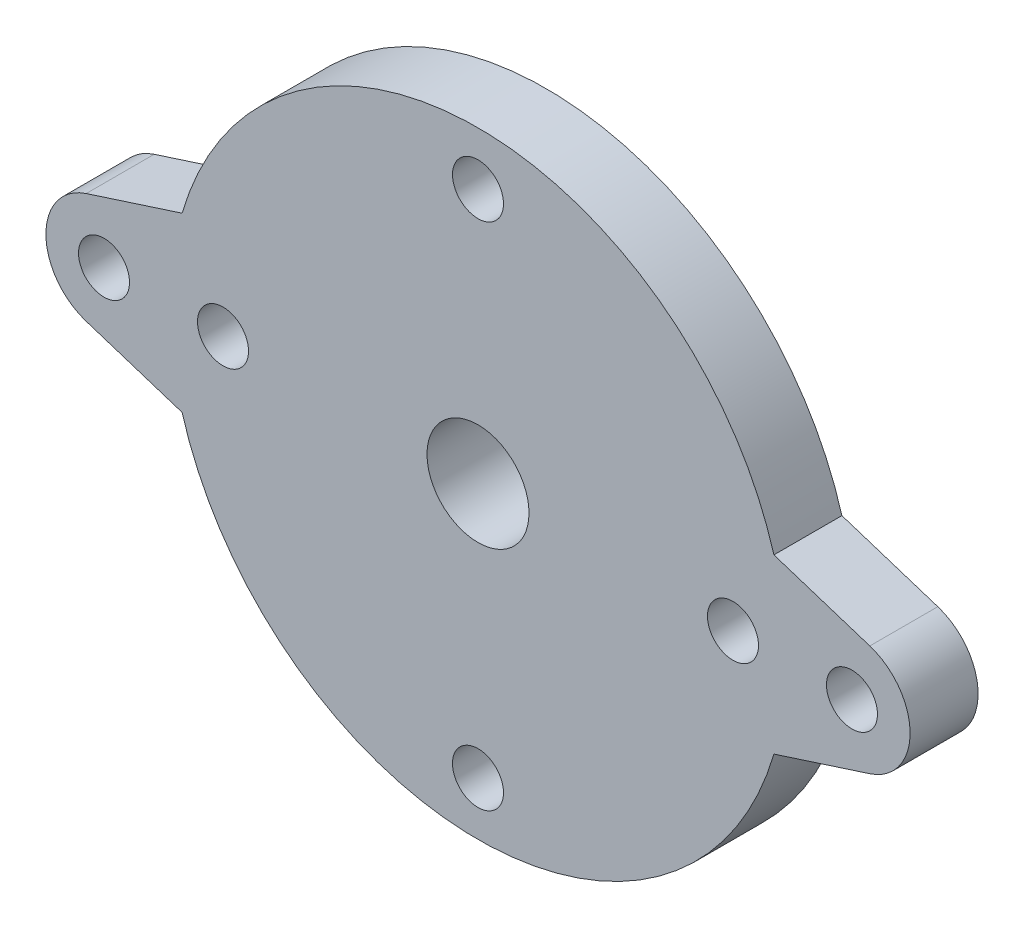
ISO-10303-21;
HEADER;
FILE_DESCRIPTION(('STEP AP214'),'2;1');
FILE_NAME('part.step','',(''),(''),'','','');
FILE_SCHEMA(('AUTOMOTIVE_DESIGN { 1 0 10303 214 1 1 1 1 }'));
ENDSEC;
DATA;
#1=APPLICATION_CONTEXT('core data for automotive mechanical design processes');
#2=APPLICATION_PROTOCOL_DEFINITION('international standard','automotive_design',2000,#1);
#3=PRODUCT_CONTEXT('',#1,'mechanical');
#4=PRODUCT('Part','Part','',(#3));
#5=PRODUCT_RELATED_PRODUCT_CATEGORY('part','',(#4));
#6=PRODUCT_DEFINITION_FORMATION('','',#4);
#7=PRODUCT_DEFINITION_CONTEXT('part definition',#1,'design');
#8=PRODUCT_DEFINITION('design','',#6,#7);
#9=PRODUCT_DEFINITION_SHAPE('','',#8);
#10=(LENGTH_UNIT() NAMED_UNIT(*) SI_UNIT(.MILLI.,.METRE.));
#11=(NAMED_UNIT(*) PLANE_ANGLE_UNIT() SI_UNIT($,.RADIAN.));
#12=(NAMED_UNIT(*) SI_UNIT($,.STERADIAN.) SOLID_ANGLE_UNIT());
#13=UNCERTAINTY_MEASURE_WITH_UNIT(LENGTH_MEASURE(1.E-05),#10,'distance_accuracy_value','');
#14=(GEOMETRIC_REPRESENTATION_CONTEXT(3) GLOBAL_UNCERTAINTY_ASSIGNED_CONTEXT((#13)) GLOBAL_UNIT_ASSIGNED_CONTEXT((#10,
#11,#12)) REPRESENTATION_CONTEXT('',''));
#15=CARTESIAN_POINT('',(0.,0.,0.));
#16=DIRECTION('',(0.,0.,1.));
#17=DIRECTION('',(1.,0.,0.));
#18=AXIS2_PLACEMENT_3D('',#15,#16,#17);
#19=CARTESIAN_POINT('',(-22.,0.,4.));
#20=DIRECTION('',(0.,0.,-1.));
#21=DIRECTION('',(-1.,0.,0.));
#22=AXIS2_PLACEMENT_3D('',#19,#20,#21);
#23=CYLINDRICAL_SURFACE('',#22,1.5);
#24=CARTESIAN_POINT('',(-22.,0.,4.));
#25=DIRECTION('',(0.,0.,-1.));
#26=DIRECTION('',(-1.,0.,0.));
#27=AXIS2_PLACEMENT_3D('',#24,#25,#26);
#28=CIRCLE('',#27,1.5);
#29=CARTESIAN_POINT('',(-23.5,0.,4.));
#30=VERTEX_POINT('',#29);
#31=EDGE_CURVE('E197',#30,#30,#28,.T.);
#32=ORIENTED_EDGE('',*,*,#31,.F.);
#33=EDGE_LOOP('',(#32));
#34=FACE_BOUND('',#33,.T.);
#35=CARTESIAN_POINT('',(-22.,0.,0.2));
#36=DIRECTION('',(0.,0.,-1.));
#37=DIRECTION('',(-1.,0.,0.));
#38=AXIS2_PLACEMENT_3D('',#35,#36,#37);
#39=CIRCLE('',#38,1.5);
#40=CARTESIAN_POINT('',(-23.5,0.,0.2));
#41=VERTEX_POINT('',#40);
#42=EDGE_CURVE('E41',#41,#41,#39,.F.);
#43=ORIENTED_EDGE('',*,*,#42,.F.);
#44=EDGE_LOOP('',(#43));
#45=FACE_BOUND('',#44,.T.);
#46=ADVANCED_FACE('F37',(#34,#45),#23,.F.);
#47=CARTESIAN_POINT('',(22.,0.,4.));
#48=DIRECTION('',(0.,0.,-1.));
#49=DIRECTION('',(-1.,0.,0.));
#50=AXIS2_PLACEMENT_3D('',#47,#48,#49);
#51=CYLINDRICAL_SURFACE('',#50,1.5);
#52=CARTESIAN_POINT('',(22.,0.,4.));
#53=DIRECTION('',(0.,0.,-1.));
#54=DIRECTION('',(-1.,0.,0.));
#55=AXIS2_PLACEMENT_3D('',#52,#53,#54);
#56=CIRCLE('',#55,1.5);
#57=CARTESIAN_POINT('',(20.5,0.,4.));
#58=VERTEX_POINT('',#57);
#59=EDGE_CURVE('E141',#58,#58,#56,.T.);
#60=ORIENTED_EDGE('',*,*,#59,.F.);
#61=EDGE_LOOP('',(#60));
#62=FACE_BOUND('',#61,.T.);
#63=CARTESIAN_POINT('',(22.,0.,0.2));
#64=DIRECTION('',(0.,0.,-1.));
#65=DIRECTION('',(-1.,0.,0.));
#66=AXIS2_PLACEMENT_3D('',#63,#64,#65);
#67=CIRCLE('',#66,1.5);
#68=CARTESIAN_POINT('',(20.5,0.,0.2));
#69=VERTEX_POINT('',#68);
#70=EDGE_CURVE('E165',#69,#69,#67,.F.);
#71=ORIENTED_EDGE('',*,*,#70,.F.);
#72=EDGE_LOOP('',(#71));
#73=FACE_BOUND('',#72,.T.);
#74=ADVANCED_FACE('F231',(#62,#73),#51,.F.);
#75=CARTESIAN_POINT('',(3.12028176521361,9.67942031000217,4.));
#76=DIRECTION('',(-0.306814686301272,-0.951769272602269,0.));
#77=DIRECTION('',(0.951769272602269,-0.306814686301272,0.));
#78=AXIS2_PLACEMENT_3D('',#75,#76,#77);
#79=PLANE('',#78);
#80=DIRECTION('',(-0.951769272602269,0.306814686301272,0.));
#81=VECTOR('',#80,1.);
#82=CARTESIAN_POINT('',(3.12028176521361,9.67942031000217,0.));
#83=LINE('',#82,#81);
#84=CARTESIAN_POINT('',(23.0493062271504,3.25505091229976,0.));
#85=VERTEX_POINT('',#84);
#86=CARTESIAN_POINT('',(17.4077918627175,5.07366337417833,0.));
#87=VERTEX_POINT('',#86);
#88=EDGE_CURVE('E138',#85,#87,#83,.T.);
#89=ORIENTED_EDGE('',*,*,#88,.T.);
#90=DIRECTION('',(0.,0.,-1.));
#91=VECTOR('',#90,1.);
#92=CARTESIAN_POINT('',(17.4077918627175,5.07366337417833,4.));
#93=LINE('',#92,#91);
#94=CARTESIAN_POINT('',(17.4077918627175,5.07366337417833,4.));
#95=VERTEX_POINT('',#94);
#96=EDGE_CURVE('E11',#95,#87,#93,.T.);
#97=ORIENTED_EDGE('',*,*,#96,.F.);
#98=DIRECTION('',(-0.951769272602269,0.306814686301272,0.));
#99=VECTOR('',#98,1.);
#100=CARTESIAN_POINT('',(3.12028176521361,9.67942031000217,4.));
#101=LINE('',#100,#99);
#102=CARTESIAN_POINT('',(23.0493062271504,3.25505091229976,4.));
#103=VERTEX_POINT('',#102);
#104=EDGE_CURVE('E156',#103,#95,#101,.T.);
#105=ORIENTED_EDGE('',*,*,#104,.F.);
#106=DIRECTION('',(0.,0.,-1.));
#107=VECTOR('',#106,1.);
#108=CARTESIAN_POINT('',(23.0493062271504,3.25505091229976,4.));
#109=LINE('',#108,#107);
#110=EDGE_CURVE('E56',#103,#85,#109,.T.);
#111=ORIENTED_EDGE('',*,*,#110,.T.);
#112=EDGE_LOOP('',(#89,#97,#105,#111));
#113=FACE_BOUND('',#112,.T.);
#114=ADVANCED_FACE('F39',(#113),#79,.F.);
#115=CARTESIAN_POINT('',(0.,0.,4.));
#116=DIRECTION('',(0.,0.,-1.));
#117=DIRECTION('',(-1.,0.,0.));
#118=AXIS2_PLACEMENT_3D('',#115,#116,#117);
#119=CYLINDRICAL_SURFACE('',#118,18.1321062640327);
#120=CARTESIAN_POINT('',(0.,0.,0.));
#121=DIRECTION('',(0.,0.,1.));
#122=DIRECTION('',(1.,0.,0.));
#123=AXIS2_PLACEMENT_3D('',#120,#121,#122);
#124=CIRCLE('',#123,18.1321062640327);
#125=CARTESIAN_POINT('',(-17.4077918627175,5.07366337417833,0.));
#126=VERTEX_POINT('',#125);
#127=EDGE_CURVE('E140',#87,#126,#124,.T.);
#128=ORIENTED_EDGE('',*,*,#127,.T.);
#129=DIRECTION('',(0.,0.,-1.));
#130=VECTOR('',#129,1.);
#131=CARTESIAN_POINT('',(-17.4077918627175,5.07366337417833,4.));
#132=LINE('',#131,#130);
#133=CARTESIAN_POINT('',(-17.4077918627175,5.07366337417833,4.));
#134=VERTEX_POINT('',#133);
#135=EDGE_CURVE('E47',#134,#126,#132,.T.);
#136=ORIENTED_EDGE('',*,*,#135,.F.);
#137=CARTESIAN_POINT('',(0.,0.,4.));
#138=DIRECTION('',(0.,0.,1.));
#139=DIRECTION('',(1.,0.,0.));
#140=AXIS2_PLACEMENT_3D('',#137,#138,#139);
#141=CIRCLE('',#140,18.1321062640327);
#142=EDGE_CURVE('E94',#95,#134,#141,.T.);
#143=ORIENTED_EDGE('',*,*,#142,.F.);
#144=ORIENTED_EDGE('',*,*,#96,.T.);
#145=EDGE_LOOP('',(#128,#136,#143,#144));
#146=FACE_BOUND('',#145,.T.);
#147=ADVANCED_FACE('F628',(#146),#119,.T.);
#148=CARTESIAN_POINT('',(-3.12028176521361,9.67942031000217,4.));
#149=DIRECTION('',(-0.306814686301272,0.951769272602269,0.));
#150=DIRECTION('',(-0.951769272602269,-0.306814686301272,0.));
#151=AXIS2_PLACEMENT_3D('',#148,#149,#150);
#152=PLANE('',#151);
#153=DIRECTION('',(0.951769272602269,0.306814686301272,0.));
#154=VECTOR('',#153,1.);
#155=CARTESIAN_POINT('',(-3.12028176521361,9.67942031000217,0.));
#156=LINE('',#155,#154);
#157=CARTESIAN_POINT('',(-23.0493062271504,3.25505091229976,0.));
#158=VERTEX_POINT('',#157);
#159=EDGE_CURVE('E144',#158,#126,#156,.T.);
#160=ORIENTED_EDGE('',*,*,#159,.F.);
#161=DIRECTION('',(0.,0.,-1.));
#162=VECTOR('',#161,1.);
#163=CARTESIAN_POINT('',(-23.0493062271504,3.25505091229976,4.));
#164=LINE('',#163,#162);
#165=CARTESIAN_POINT('',(-23.0493062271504,3.25505091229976,4.));
#166=VERTEX_POINT('',#165);
#167=EDGE_CURVE('E163',#166,#158,#164,.T.);
#168=ORIENTED_EDGE('',*,*,#167,.F.);
#169=DIRECTION('',(0.951769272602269,0.306814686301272,0.));
#170=VECTOR('',#169,1.);
#171=CARTESIAN_POINT('',(-3.12028176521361,9.67942031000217,4.));
#172=LINE('',#171,#170);
#173=EDGE_CURVE('E205',#166,#134,#172,.T.);
#174=ORIENTED_EDGE('',*,*,#173,.T.);
#175=ORIENTED_EDGE('',*,*,#135,.T.);
#176=EDGE_LOOP('',(#160,#168,#174,#175));
#177=FACE_BOUND('',#176,.T.);
#178=ADVANCED_FACE('F337',(#177),#152,.T.);
#179=CARTESIAN_POINT('',(-22.,0.,4.));
#180=DIRECTION('',(0.,0.,-1.));
#181=DIRECTION('',(-1.,0.,0.));
#182=AXIS2_PLACEMENT_3D('',#179,#180,#181);
#183=CYLINDRICAL_SURFACE('',#182,3.42);
#184=CARTESIAN_POINT('',(-22.,0.,0.));
#185=DIRECTION('',(0.,0.,1.));
#186=DIRECTION('',(1.,0.,0.));
#187=AXIS2_PLACEMENT_3D('',#184,#185,#186);
#188=CIRCLE('',#187,3.42);
#189=CARTESIAN_POINT('',(-23.0493062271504,-3.25505091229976,0.));
#190=VERTEX_POINT('',#189);
#191=EDGE_CURVE('E147',#158,#190,#188,.T.);
#192=ORIENTED_EDGE('',*,*,#191,.T.);
#193=DIRECTION('',(0.,0.,-1.));
#194=VECTOR('',#193,1.);
#195=CARTESIAN_POINT('',(-23.0493062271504,-3.25505091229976,4.));
#196=LINE('',#195,#194);
#197=CARTESIAN_POINT('',(-23.0493062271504,-3.25505091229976,4.));
#198=VERTEX_POINT('',#197);
#199=EDGE_CURVE('E160',#198,#190,#196,.T.);
#200=ORIENTED_EDGE('',*,*,#199,.F.);
#201=CARTESIAN_POINT('',(-22.,0.,4.));
#202=DIRECTION('',(0.,0.,1.));
#203=DIRECTION('',(1.,0.,0.));
#204=AXIS2_PLACEMENT_3D('',#201,#202,#203);
#205=CIRCLE('',#204,3.42);
#206=EDGE_CURVE('E207',#166,#198,#205,.T.);
#207=ORIENTED_EDGE('',*,*,#206,.F.);
#208=ORIENTED_EDGE('',*,*,#167,.T.);
#209=EDGE_LOOP('',(#192,#200,#207,#208));
#210=FACE_BOUND('',#209,.T.);
#211=ADVANCED_FACE('F212',(#210),#183,.T.);
#212=CARTESIAN_POINT('',(-3.12028176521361,-9.67942031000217,4.));
#213=DIRECTION('',(0.306814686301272,0.951769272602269,0.));
#214=DIRECTION('',(-0.951769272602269,0.306814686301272,0.));
#215=AXIS2_PLACEMENT_3D('',#212,#213,#214);
#216=PLANE('',#215);
#217=DIRECTION('',(0.951769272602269,-0.306814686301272,0.));
#218=VECTOR('',#217,1.);
#219=CARTESIAN_POINT('',(-3.12028176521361,-9.67942031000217,0.));
#220=LINE('',#219,#218);
#221=CARTESIAN_POINT('',(-17.4077918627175,-5.07366337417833,0.));
#222=VERTEX_POINT('',#221);
#223=EDGE_CURVE('E149',#190,#222,#220,.T.);
#224=ORIENTED_EDGE('',*,*,#223,.T.);
#225=DIRECTION('',(0.,0.,-1.));
#226=VECTOR('',#225,1.);
#227=CARTESIAN_POINT('',(-17.4077918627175,-5.07366337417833,4.));
#228=LINE('',#227,#226);
#229=CARTESIAN_POINT('',(-17.4077918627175,-5.07366337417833,4.));
#230=VERTEX_POINT('',#229);
#231=EDGE_CURVE('E129',#230,#222,#228,.T.);
#232=ORIENTED_EDGE('',*,*,#231,.F.);
#233=DIRECTION('',(0.951769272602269,-0.306814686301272,0.));
#234=VECTOR('',#233,1.);
#235=CARTESIAN_POINT('',(-3.12028176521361,-9.67942031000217,4.));
#236=LINE('',#235,#234);
#237=EDGE_CURVE('E117',#198,#230,#236,.T.);
#238=ORIENTED_EDGE('',*,*,#237,.F.);
#239=ORIENTED_EDGE('',*,*,#199,.T.);
#240=EDGE_LOOP('',(#224,#232,#238,#239));
#241=FACE_BOUND('',#240,.T.);
#242=ADVANCED_FACE('F216',(#241),#216,.F.);
#243=CARTESIAN_POINT('',(17.4077918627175,-5.07366337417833,0.));
#244=VERTEX_POINT('',#243);
#245=EDGE_CURVE('E126',#222,#244,#124,.T.);
#246=ORIENTED_EDGE('',*,*,#245,.T.);
#247=DIRECTION('',(0.,0.,-1.));
#248=VECTOR('',#247,1.);
#249=CARTESIAN_POINT('',(17.4077918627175,-5.07366337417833,4.));
#250=LINE('',#249,#248);
#251=CARTESIAN_POINT('',(17.4077918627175,-5.07366337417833,4.));
#252=VERTEX_POINT('',#251);
#253=EDGE_CURVE('E123',#252,#244,#250,.T.);
#254=ORIENTED_EDGE('',*,*,#253,.F.);
#255=EDGE_CURVE('E110',#230,#252,#141,.T.);
#256=ORIENTED_EDGE('',*,*,#255,.F.);
#257=ORIENTED_EDGE('',*,*,#231,.T.);
#258=EDGE_LOOP('',(#246,#254,#256,#257));
#259=FACE_BOUND('',#258,.T.);
#260=ADVANCED_FACE('F124',(#259),#119,.T.);
#261=CARTESIAN_POINT('',(3.12028176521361,-9.67942031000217,4.));
#262=DIRECTION('',(0.306814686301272,-0.951769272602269,0.));
#263=DIRECTION('',(0.951769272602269,0.306814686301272,0.));
#264=AXIS2_PLACEMENT_3D('',#261,#262,#263);
#265=PLANE('',#264);
#266=DIRECTION('',(-0.951769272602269,-0.306814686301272,0.));
#267=VECTOR('',#266,1.);
#268=CARTESIAN_POINT('',(3.12028176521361,-9.67942031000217,0.));
#269=LINE('',#268,#267);
#270=CARTESIAN_POINT('',(23.0493062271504,-3.25505091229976,0.));
#271=VERTEX_POINT('',#270);
#272=EDGE_CURVE('E151',#271,#244,#269,.T.);
#273=ORIENTED_EDGE('',*,*,#272,.F.);
#274=DIRECTION('',(0.,0.,-1.));
#275=VECTOR('',#274,1.);
#276=CARTESIAN_POINT('',(23.0493062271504,-3.25505091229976,4.));
#277=LINE('',#276,#275);
#278=CARTESIAN_POINT('',(23.0493062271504,-3.25505091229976,4.));
#279=VERTEX_POINT('',#278);
#280=EDGE_CURVE('E82',#279,#271,#277,.T.);
#281=ORIENTED_EDGE('',*,*,#280,.F.);
#282=DIRECTION('',(-0.951769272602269,-0.306814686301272,0.));
#283=VECTOR('',#282,1.);
#284=CARTESIAN_POINT('',(3.12028176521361,-9.67942031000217,4.));
#285=LINE('',#284,#283);
#286=EDGE_CURVE('E115',#279,#252,#285,.T.);
#287=ORIENTED_EDGE('',*,*,#286,.T.);
#288=ORIENTED_EDGE('',*,*,#253,.T.);
#289=EDGE_LOOP('',(#273,#281,#287,#288));
#290=FACE_BOUND('',#289,.T.);
#291=ADVANCED_FACE('F131',(#290),#265,.T.);
#292=CARTESIAN_POINT('',(22.,0.,4.));
#293=DIRECTION('',(0.,0.,-1.));
#294=DIRECTION('',(-1.,0.,0.));
#295=AXIS2_PLACEMENT_3D('',#292,#293,#294);
#296=CYLINDRICAL_SURFACE('',#295,3.42);
#297=CARTESIAN_POINT('',(22.,0.,0.));
#298=DIRECTION('',(0.,0.,1.));
#299=DIRECTION('',(1.,0.,0.));
#300=AXIS2_PLACEMENT_3D('',#297,#298,#299);
#301=CIRCLE('',#300,3.42);
#302=EDGE_CURVE('E153',#85,#271,#301,.F.);
#303=ORIENTED_EDGE('',*,*,#302,.F.);
#304=ORIENTED_EDGE('',*,*,#110,.F.);
#305=CARTESIAN_POINT('',(22.,0.,4.));
#306=DIRECTION('',(0.,0.,1.));
#307=DIRECTION('',(1.,0.,0.));
#308=AXIS2_PLACEMENT_3D('',#305,#306,#307);
#309=CIRCLE('',#308,3.42);
#310=EDGE_CURVE('E132',#103,#279,#309,.F.);
#311=ORIENTED_EDGE('',*,*,#310,.T.);
#312=ORIENTED_EDGE('',*,*,#280,.T.);
#313=EDGE_LOOP('',(#303,#304,#311,#312));
#314=FACE_BOUND('',#313,.T.);
#315=ADVANCED_FACE('F219',(#314),#296,.T.);
#316=CARTESIAN_POINT('',(0.,0.,4.));
#317=DIRECTION('',(0.,0.,1.));
#318=DIRECTION('',(1.,0.,0.));
#319=AXIS2_PLACEMENT_3D('',#316,#317,#318);
#320=PLANE('',#319);
#321=CARTESIAN_POINT('',(0.,-15.,4.));
#322=DIRECTION('',(0.,0.,1.));
#323=DIRECTION('',(1.,0.,0.));
#324=AXIS2_PLACEMENT_3D('',#321,#322,#323);
#325=CIRCLE('',#324,1.5);
#326=CARTESIAN_POINT('',(1.5,-15.,4.));
#327=VERTEX_POINT('',#326);
#328=EDGE_CURVE('E511',#327,#327,#325,.T.);
#329=ORIENTED_EDGE('',*,*,#328,.F.);
#330=EDGE_LOOP('',(#329));
#331=FACE_BOUND('',#330,.T.);
#332=CARTESIAN_POINT('',(-15.,0.,4.));
#333=DIRECTION('',(0.,0.,1.));
#334=DIRECTION('',(1.,0.,0.));
#335=AXIS2_PLACEMENT_3D('',#332,#333,#334);
#336=CIRCLE('',#335,1.5);
#337=CARTESIAN_POINT('',(-13.5,0.,4.));
#338=VERTEX_POINT('',#337);
#339=EDGE_CURVE('E505',#338,#338,#336,.T.);
#340=ORIENTED_EDGE('',*,*,#339,.F.);
#341=EDGE_LOOP('',(#340));
#342=FACE_BOUND('',#341,.T.);
#343=CARTESIAN_POINT('',(0.,15.,4.));
#344=DIRECTION('',(0.,0.,1.));
#345=DIRECTION('',(1.,0.,0.));
#346=AXIS2_PLACEMENT_3D('',#343,#344,#345);
#347=CIRCLE('',#346,1.5);
#348=CARTESIAN_POINT('',(1.5,15.,4.));
#349=VERTEX_POINT('',#348);
#350=EDGE_CURVE('E499',#349,#349,#347,.T.);
#351=ORIENTED_EDGE('',*,*,#350,.F.);
#352=EDGE_LOOP('',(#351));
#353=FACE_BOUND('',#352,.T.);
#354=CARTESIAN_POINT('',(15.,0.,4.));
#355=DIRECTION('',(0.,0.,1.));
#356=DIRECTION('',(1.,0.,0.));
#357=AXIS2_PLACEMENT_3D('',#354,#355,#356);
#358=CIRCLE('',#357,1.5);
#359=CARTESIAN_POINT('',(16.5,0.,4.));
#360=VERTEX_POINT('',#359);
#361=EDGE_CURVE('E491',#360,#360,#358,.T.);
#362=ORIENTED_EDGE('',*,*,#361,.F.);
#363=EDGE_LOOP('',(#362));
#364=FACE_BOUND('',#363,.T.);
#365=CARTESIAN_POINT('',(0.,0.,4.));
#366=DIRECTION('',(0.,0.,1.));
#367=DIRECTION('',(1.,0.,0.));
#368=AXIS2_PLACEMENT_3D('',#365,#366,#367);
#369=CIRCLE('',#368,3.);
#370=CARTESIAN_POINT('',(3.,0.,4.));
#371=VERTEX_POINT('',#370);
#372=EDGE_CURVE('E172',#371,#371,#369,.T.);
#373=ORIENTED_EDGE('',*,*,#372,.F.);
#374=EDGE_LOOP('',(#373));
#375=FACE_BOUND('',#374,.T.);
#376=ORIENTED_EDGE('',*,*,#31,.T.);
#377=EDGE_LOOP('',(#376));
#378=FACE_BOUND('',#377,.T.);
#379=ORIENTED_EDGE('',*,*,#59,.T.);
#380=EDGE_LOOP('',(#379));
#381=FACE_BOUND('',#380,.T.);
#382=ORIENTED_EDGE('',*,*,#104,.T.);
#383=ORIENTED_EDGE('',*,*,#142,.T.);
#384=ORIENTED_EDGE('',*,*,#173,.F.);
#385=ORIENTED_EDGE('',*,*,#206,.T.);
#386=ORIENTED_EDGE('',*,*,#237,.T.);
#387=ORIENTED_EDGE('',*,*,#255,.T.);
#388=ORIENTED_EDGE('',*,*,#286,.F.);
#389=ORIENTED_EDGE('',*,*,#310,.F.);
#390=EDGE_LOOP('',(#382,#383,#384,#385,#386,#387,#388,#389));
#391=FACE_BOUND('',#390,.T.);
#392=ADVANCED_FACE('F112',(#331,#342,#353,#364,#375,#378,#381,#391),#320,.T.);
#393=CARTESIAN_POINT('',(0.,0.,0.));
#394=DIRECTION('',(0.,0.,1.));
#395=DIRECTION('',(1.,0.,0.));
#396=AXIS2_PLACEMENT_3D('',#393,#394,#395);
#397=PLANE('',#396);
#398=CARTESIAN_POINT('',(0.,-15.,0.));
#399=DIRECTION('',(0.,0.,-1.));
#400=DIRECTION('',(-1.,0.,0.));
#401=AXIS2_PLACEMENT_3D('',#398,#399,#400);
#402=CIRCLE('',#401,2.);
#403=CARTESIAN_POINT('',(-2.,-15.,0.));
#404=VERTEX_POINT('',#403);
#405=EDGE_CURVE('E254',#404,#404,#402,.T.);
#406=ORIENTED_EDGE('',*,*,#405,.F.);
#407=EDGE_LOOP('',(#406));
#408=FACE_BOUND('',#407,.T.);
#409=CARTESIAN_POINT('',(-15.,0.,0.));
#410=DIRECTION('',(0.,0.,-1.));
#411=DIRECTION('',(-1.,0.,0.));
#412=AXIS2_PLACEMENT_3D('',#409,#410,#411);
#413=CIRCLE('',#412,2.);
#414=CARTESIAN_POINT('',(-17.,0.,0.));
#415=VERTEX_POINT('',#414);
#416=EDGE_CURVE('E258',#415,#415,#413,.T.);
#417=ORIENTED_EDGE('',*,*,#416,.F.);
#418=EDGE_LOOP('',(#417));
#419=FACE_BOUND('',#418,.T.);
#420=CARTESIAN_POINT('',(0.,15.,0.));
#421=DIRECTION('',(0.,0.,-1.));
#422=DIRECTION('',(-1.,0.,0.));
#423=AXIS2_PLACEMENT_3D('',#420,#421,#422);
#424=CIRCLE('',#423,2.);
#425=CARTESIAN_POINT('',(-2.,15.,0.));
#426=VERTEX_POINT('',#425);
#427=EDGE_CURVE('E262',#426,#426,#424,.T.);
#428=ORIENTED_EDGE('',*,*,#427,.F.);
#429=EDGE_LOOP('',(#428));
#430=FACE_BOUND('',#429,.T.);
#431=CARTESIAN_POINT('',(15.,0.,0.));
#432=DIRECTION('',(0.,0.,-1.));
#433=DIRECTION('',(-1.,0.,0.));
#434=AXIS2_PLACEMENT_3D('',#431,#432,#433);
#435=CIRCLE('',#434,2.);
#436=CARTESIAN_POINT('',(13.,0.,0.));
#437=VERTEX_POINT('',#436);
#438=EDGE_CURVE('E266',#437,#437,#435,.T.);
#439=ORIENTED_EDGE('',*,*,#438,.F.);
#440=EDGE_LOOP('',(#439));
#441=FACE_BOUND('',#440,.T.);
#442=CARTESIAN_POINT('',(-22.,0.,0.));
#443=DIRECTION('',(0.,0.,-1.));
#444=DIRECTION('',(-1.,0.,0.));
#445=AXIS2_PLACEMENT_3D('',#442,#443,#444);
#446=CIRCLE('',#445,2.99999999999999);
#447=CARTESIAN_POINT('',(-25.,0.,0.));
#448=VERTEX_POINT('',#447);
#449=EDGE_CURVE('E182',#448,#448,#446,.T.);
#450=ORIENTED_EDGE('',*,*,#449,.F.);
#451=EDGE_LOOP('',(#450));
#452=FACE_BOUND('',#451,.T.);
#453=CARTESIAN_POINT('',(22.,0.,0.));
#454=DIRECTION('',(0.,0.,-1.));
#455=DIRECTION('',(-1.,0.,0.));
#456=AXIS2_PLACEMENT_3D('',#453,#454,#455);
#457=CIRCLE('',#456,3.);
#458=CARTESIAN_POINT('',(19.,0.,0.));
#459=VERTEX_POINT('',#458);
#460=EDGE_CURVE('E175',#459,#459,#457,.T.);
#461=ORIENTED_EDGE('',*,*,#460,.F.);
#462=EDGE_LOOP('',(#461));
#463=FACE_BOUND('',#462,.T.);
#464=CARTESIAN_POINT('',(0.,0.,0.));
#465=DIRECTION('',(0.,0.,-1.));
#466=DIRECTION('',(-1.,0.,0.));
#467=AXIS2_PLACEMENT_3D('',#464,#465,#466);
#468=CIRCLE('',#467,8.4);
#469=CARTESIAN_POINT('',(-8.4,0.,0.));
#470=VERTEX_POINT('',#469);
#471=EDGE_CURVE('E193',#470,#470,#468,.T.);
#472=ORIENTED_EDGE('',*,*,#471,.F.);
#473=EDGE_LOOP('',(#472));
#474=FACE_BOUND('',#473,.T.);
#475=ORIENTED_EDGE('',*,*,#88,.F.);
#476=ORIENTED_EDGE('',*,*,#302,.T.);
#477=ORIENTED_EDGE('',*,*,#272,.T.);
#478=ORIENTED_EDGE('',*,*,#245,.F.);
#479=ORIENTED_EDGE('',*,*,#223,.F.);
#480=ORIENTED_EDGE('',*,*,#191,.F.);
#481=ORIENTED_EDGE('',*,*,#159,.T.);
#482=ORIENTED_EDGE('',*,*,#127,.F.);
#483=EDGE_LOOP('',(#475,#476,#477,#478,#479,#480,#481,#482));
#484=FACE_BOUND('',#483,.T.);
#485=ADVANCED_FACE('F218',(#408,#419,#430,#441,#452,#463,#474,#484),#397,.F.);
#486=CARTESIAN_POINT('',(0.,0.,0.5));
#487=DIRECTION('',(0.,0.,-1.));
#488=DIRECTION('',(-1.,0.,0.));
#489=AXIS2_PLACEMENT_3D('',#486,#487,#488);
#490=CYLINDRICAL_SURFACE('',#489,8.4);
#491=CARTESIAN_POINT('',(0.,0.,0.5));
#492=DIRECTION('',(0.,0.,-1.));
#493=DIRECTION('',(-1.,0.,0.));
#494=AXIS2_PLACEMENT_3D('',#491,#492,#493);
#495=CIRCLE('',#494,8.4);
#496=CARTESIAN_POINT('',(-8.4,0.,0.5));
#497=VERTEX_POINT('',#496);
#498=EDGE_CURVE('E194',#497,#497,#495,.T.);
#499=ORIENTED_EDGE('',*,*,#498,.F.);
#500=EDGE_LOOP('',(#499));
#501=FACE_BOUND('',#500,.T.);
#502=ORIENTED_EDGE('',*,*,#471,.T.);
#503=EDGE_LOOP('',(#502));
#504=FACE_BOUND('',#503,.T.);
#505=ADVANCED_FACE('F242',(#501,#504),#490,.F.);
#506=CARTESIAN_POINT('',(0.,0.,0.5));
#507=DIRECTION('',(0.,0.,-1.));
#508=DIRECTION('',(-1.,0.,0.));
#509=AXIS2_PLACEMENT_3D('',#506,#507,#508);
#510=PLANE('',#509);
#511=CARTESIAN_POINT('',(0.,0.,0.5));
#512=DIRECTION('',(0.,0.,-1.));
#513=DIRECTION('',(-1.,0.,0.));
#514=AXIS2_PLACEMENT_3D('',#511,#512,#513);
#515=CIRCLE('',#514,8.);
#516=CARTESIAN_POINT('',(-8.,0.,0.5));
#517=VERTEX_POINT('',#516);
#518=EDGE_CURVE('E190',#517,#517,#515,.T.);
#519=ORIENTED_EDGE('',*,*,#518,.F.);
#520=EDGE_LOOP('',(#519));
#521=FACE_BOUND('',#520,.T.);
#522=ORIENTED_EDGE('',*,*,#498,.T.);
#523=EDGE_LOOP('',(#522));
#524=FACE_BOUND('',#523,.T.);
#525=ADVANCED_FACE('F249',(#521,#524),#510,.T.);
#526=CARTESIAN_POINT('',(0.,0.,0.5));
#527=DIRECTION('',(0.,0.,-1.));
#528=DIRECTION('',(-1.,0.,0.));
#529=AXIS2_PLACEMENT_3D('',#526,#527,#528);
#530=CYLINDRICAL_SURFACE('',#529,8.);
#531=ORIENTED_EDGE('',*,*,#518,.T.);
#532=EDGE_LOOP('',(#531));
#533=FACE_BOUND('',#532,.T.);
#534=CARTESIAN_POINT('',(0.,0.,-2.2));
#535=DIRECTION('',(0.,0.,-1.));
#536=DIRECTION('',(-1.,0.,0.));
#537=AXIS2_PLACEMENT_3D('',#534,#535,#536);
#538=CIRCLE('',#537,8.);
#539=CARTESIAN_POINT('',(-8.,0.,-2.2));
#540=VERTEX_POINT('',#539);
#541=EDGE_CURVE('E187',#540,#540,#538,.T.);
#542=ORIENTED_EDGE('',*,*,#541,.F.);
#543=EDGE_LOOP('',(#542));
#544=FACE_BOUND('',#543,.T.);
#545=ADVANCED_FACE('F298',(#533,#544),#530,.T.);
#546=CARTESIAN_POINT('',(0.,0.,-2.2));
#547=DIRECTION('',(0.,0.,-1.));
#548=DIRECTION('',(-1.,0.,0.));
#549=AXIS2_PLACEMENT_3D('',#546,#547,#548);
#550=PLANE('',#549);
#551=CARTESIAN_POINT('',(0.,0.,-2.2));
#552=DIRECTION('',(0.,0.,-1.));
#553=DIRECTION('',(-1.,0.,0.));
#554=AXIS2_PLACEMENT_3D('',#551,#552,#553);
#555=CIRCLE('',#554,3.);
#556=CARTESIAN_POINT('',(-3.,0.,-2.2));
#557=VERTEX_POINT('',#556);
#558=EDGE_CURVE('E167',#557,#557,#555,.T.);
#559=ORIENTED_EDGE('',*,*,#558,.F.);
#560=EDGE_LOOP('',(#559));
#561=FACE_BOUND('',#560,.T.);
#562=ORIENTED_EDGE('',*,*,#541,.T.);
#563=EDGE_LOOP('',(#562));
#564=FACE_BOUND('',#563,.T.);
#565=ADVANCED_FACE('F294',(#561,#564),#550,.T.);
#566=CARTESIAN_POINT('',(0.,0.,17.8));
#567=DIRECTION('',(0.,0.,-1.));
#568=DIRECTION('',(-1.,0.,0.));
#569=AXIS2_PLACEMENT_3D('',#566,#567,#568);
#570=CYLINDRICAL_SURFACE('',#569,3.);
#571=ORIENTED_EDGE('',*,*,#372,.T.);
#572=EDGE_LOOP('',(#571));
#573=FACE_BOUND('',#572,.T.);
#574=ORIENTED_EDGE('',*,*,#558,.T.);
#575=EDGE_LOOP('',(#574));
#576=FACE_BOUND('',#575,.T.);
#577=ADVANCED_FACE('F288',(#573,#576),#570,.F.);
#578=CARTESIAN_POINT('',(22.,0.,0.2));
#579=DIRECTION('',(0.,0.,-1.));
#580=DIRECTION('',(-1.,0.,0.));
#581=AXIS2_PLACEMENT_3D('',#578,#579,#580);
#582=PLANE('',#581);
#583=CARTESIAN_POINT('',(22.,0.,0.2));
#584=DIRECTION('',(0.,0.,-1.));
#585=DIRECTION('',(-1.,0.,0.));
#586=AXIS2_PLACEMENT_3D('',#583,#584,#585);
#587=CIRCLE('',#586,3.);
#588=CARTESIAN_POINT('',(19.,0.,0.2));
#589=VERTEX_POINT('',#588);
#590=EDGE_CURVE('E168',#589,#589,#587,.T.);
#591=ORIENTED_EDGE('',*,*,#590,.T.);
#592=EDGE_LOOP('',(#591));
#593=FACE_BOUND('',#592,.T.);
#594=ORIENTED_EDGE('',*,*,#70,.T.);
#595=EDGE_LOOP('',(#594));
#596=FACE_BOUND('',#595,.T.);
#597=ADVANCED_FACE('F278',(#593,#596),#582,.T.);
#598=CARTESIAN_POINT('',(22.,0.,0.2));
#599=DIRECTION('',(0.,0.,-1.));
#600=DIRECTION('',(-1.,0.,0.));
#601=AXIS2_PLACEMENT_3D('',#598,#599,#600);
#602=CYLINDRICAL_SURFACE('',#601,3.);
#603=ORIENTED_EDGE('',*,*,#590,.F.);
#604=EDGE_LOOP('',(#603));
#605=FACE_BOUND('',#604,.T.);
#606=ORIENTED_EDGE('',*,*,#460,.T.);
#607=EDGE_LOOP('',(#606));
#608=FACE_BOUND('',#607,.T.);
#609=ADVANCED_FACE('F275',(#605,#608),#602,.F.);
#610=CARTESIAN_POINT('',(-22.,0.,0.2));
#611=DIRECTION('',(0.,0.,-1.));
#612=DIRECTION('',(-1.,0.,0.));
#613=AXIS2_PLACEMENT_3D('',#610,#611,#612);
#614=PLANE('',#613);
#615=CARTESIAN_POINT('',(-22.,0.,0.2));
#616=DIRECTION('',(0.,0.,-1.));
#617=DIRECTION('',(-1.,0.,0.));
#618=AXIS2_PLACEMENT_3D('',#615,#616,#617);
#619=CIRCLE('',#618,2.99999999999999);
#620=CARTESIAN_POINT('',(-25.,0.,0.2));
#621=VERTEX_POINT('',#620);
#622=EDGE_CURVE('E473',#621,#621,#619,.T.);
#623=ORIENTED_EDGE('',*,*,#622,.T.);
#624=EDGE_LOOP('',(#623));
#625=FACE_BOUND('',#624,.T.);
#626=ORIENTED_EDGE('',*,*,#42,.T.);
#627=EDGE_LOOP('',(#626));
#628=FACE_BOUND('',#627,.T.);
#629=ADVANCED_FACE('F277',(#625,#628),#614,.T.);
#630=CARTESIAN_POINT('',(-22.,0.,0.2));
#631=DIRECTION('',(0.,0.,-1.));
#632=DIRECTION('',(-1.,0.,0.));
#633=AXIS2_PLACEMENT_3D('',#630,#631,#632);
#634=CYLINDRICAL_SURFACE('',#633,2.99999999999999);
#635=ORIENTED_EDGE('',*,*,#622,.F.);
#636=EDGE_LOOP('',(#635));
#637=FACE_BOUND('',#636,.T.);
#638=ORIENTED_EDGE('',*,*,#449,.T.);
#639=EDGE_LOOP('',(#638));
#640=FACE_BOUND('',#639,.T.);
#641=ADVANCED_FACE('F285',(#637,#640),#634,.F.);
#642=CARTESIAN_POINT('',(15.,0.,1.5));
#643=DIRECTION('',(0.,0.,-1.));
#644=DIRECTION('',(-1.,0.,0.));
#645=AXIS2_PLACEMENT_3D('',#642,#643,#644);
#646=CYLINDRICAL_SURFACE('',#645,2.);
#647=CARTESIAN_POINT('',(15.,0.,1.5));
#648=DIRECTION('',(0.,0.,-1.));
#649=DIRECTION('',(-1.,0.,0.));
#650=AXIS2_PLACEMENT_3D('',#647,#648,#649);
#651=CIRCLE('',#650,2.);
#652=CARTESIAN_POINT('',(13.,0.,1.5));
#653=VERTEX_POINT('',#652);
#654=EDGE_CURVE('E474',#653,#653,#651,.T.);
#655=ORIENTED_EDGE('',*,*,#654,.F.);
#656=EDGE_LOOP('',(#655));
#657=FACE_BOUND('',#656,.T.);
#658=ORIENTED_EDGE('',*,*,#438,.T.);
#659=EDGE_LOOP('',(#658));
#660=FACE_BOUND('',#659,.T.);
#661=ADVANCED_FACE('F376',(#657,#660),#646,.F.);
#662=CARTESIAN_POINT('',(15.,0.,1.5));
#663=DIRECTION('',(0.,0.,-1.));
#664=DIRECTION('',(-1.,0.,0.));
#665=AXIS2_PLACEMENT_3D('',#662,#663,#664);
#666=PLANE('',#665);
#667=CARTESIAN_POINT('',(15.,0.,1.5));
#668=DIRECTION('',(0.,0.,-1.));
#669=DIRECTION('',(-1.,0.,0.));
#670=AXIS2_PLACEMENT_3D('',#667,#668,#669);
#671=CIRCLE('',#670,1.5);
#672=CARTESIAN_POINT('',(13.5,0.,1.5));
#673=VERTEX_POINT('',#672);
#674=EDGE_CURVE('E496',#673,#673,#671,.T.);
#675=ORIENTED_EDGE('',*,*,#674,.F.);
#676=EDGE_LOOP('',(#675));
#677=FACE_BOUND('',#676,.T.);
#678=ORIENTED_EDGE('',*,*,#654,.T.);
#679=EDGE_LOOP('',(#678));
#680=FACE_BOUND('',#679,.T.);
#681=ADVANCED_FACE('F370',(#677,#680),#666,.T.);
#682=CARTESIAN_POINT('',(0.,15.,1.5));
#683=DIRECTION('',(0.,0.,-1.));
#684=DIRECTION('',(-1.,0.,0.));
#685=AXIS2_PLACEMENT_3D('',#682,#683,#684);
#686=CYLINDRICAL_SURFACE('',#685,2.);
#687=CARTESIAN_POINT('',(0.,15.,1.5));
#688=DIRECTION('',(0.,0.,-1.));
#689=DIRECTION('',(-1.,0.,0.));
#690=AXIS2_PLACEMENT_3D('',#687,#688,#689);
#691=CIRCLE('',#690,2.);
#692=CARTESIAN_POINT('',(-2.,15.,1.5));
#693=VERTEX_POINT('',#692);
#694=EDGE_CURVE('E479',#693,#693,#691,.T.);
#695=ORIENTED_EDGE('',*,*,#694,.F.);
#696=EDGE_LOOP('',(#695));
#697=FACE_BOUND('',#696,.T.);
#698=ORIENTED_EDGE('',*,*,#427,.T.);
#699=EDGE_LOOP('',(#698));
#700=FACE_BOUND('',#699,.T.);
#701=ADVANCED_FACE('F375',(#697,#700),#686,.F.);
#702=CARTESIAN_POINT('',(0.,15.,1.5));
#703=DIRECTION('',(0.,0.,-1.));
#704=DIRECTION('',(-1.,0.,0.));
#705=AXIS2_PLACEMENT_3D('',#702,#703,#704);
#706=PLANE('',#705);
#707=CARTESIAN_POINT('',(0.,15.,1.5));
#708=DIRECTION('',(0.,0.,-1.));
#709=DIRECTION('',(-1.,0.,0.));
#710=AXIS2_PLACEMENT_3D('',#707,#708,#709);
#711=CIRCLE('',#710,1.5);
#712=CARTESIAN_POINT('',(-1.5,15.,1.5));
#713=VERTEX_POINT('',#712);
#714=EDGE_CURVE('E502',#713,#713,#711,.T.);
#715=ORIENTED_EDGE('',*,*,#714,.F.);
#716=EDGE_LOOP('',(#715));
#717=FACE_BOUND('',#716,.T.);
#718=ORIENTED_EDGE('',*,*,#694,.T.);
#719=EDGE_LOOP('',(#718));
#720=FACE_BOUND('',#719,.T.);
#721=ADVANCED_FACE('F386',(#717,#720),#706,.T.);
#722=CARTESIAN_POINT('',(-15.,0.,1.5));
#723=DIRECTION('',(0.,0.,-1.));
#724=DIRECTION('',(-1.,0.,0.));
#725=AXIS2_PLACEMENT_3D('',#722,#723,#724);
#726=CYLINDRICAL_SURFACE('',#725,2.);
#727=CARTESIAN_POINT('',(-15.,0.,1.5));
#728=DIRECTION('',(0.,0.,-1.));
#729=DIRECTION('',(-1.,0.,0.));
#730=AXIS2_PLACEMENT_3D('',#727,#728,#729);
#731=CIRCLE('',#730,2.);
#732=CARTESIAN_POINT('',(-17.,0.,1.5));
#733=VERTEX_POINT('',#732);
#734=EDGE_CURVE('E483',#733,#733,#731,.T.);
#735=ORIENTED_EDGE('',*,*,#734,.F.);
#736=EDGE_LOOP('',(#735));
#737=FACE_BOUND('',#736,.T.);
#738=ORIENTED_EDGE('',*,*,#416,.T.);
#739=EDGE_LOOP('',(#738));
#740=FACE_BOUND('',#739,.T.);
#741=ADVANCED_FACE('F391',(#737,#740),#726,.F.);
#742=CARTESIAN_POINT('',(-15.,0.,1.5));
#743=DIRECTION('',(0.,0.,-1.));
#744=DIRECTION('',(-1.,0.,0.));
#745=AXIS2_PLACEMENT_3D('',#742,#743,#744);
#746=PLANE('',#745);
#747=CARTESIAN_POINT('',(-15.,0.,1.5));
#748=DIRECTION('',(0.,0.,-1.));
#749=DIRECTION('',(-1.,0.,0.));
#750=AXIS2_PLACEMENT_3D('',#747,#748,#749);
#751=CIRCLE('',#750,1.5);
#752=CARTESIAN_POINT('',(-16.5,0.,1.5));
#753=VERTEX_POINT('',#752);
#754=EDGE_CURVE('E508',#753,#753,#751,.T.);
#755=ORIENTED_EDGE('',*,*,#754,.F.);
#756=EDGE_LOOP('',(#755));
#757=FACE_BOUND('',#756,.T.);
#758=ORIENTED_EDGE('',*,*,#734,.T.);
#759=EDGE_LOOP('',(#758));
#760=FACE_BOUND('',#759,.T.);
#761=ADVANCED_FACE('F399',(#757,#760),#746,.T.);
#762=CARTESIAN_POINT('',(0.,-15.,1.5));
#763=DIRECTION('',(0.,0.,-1.));
#764=DIRECTION('',(-1.,0.,0.));
#765=AXIS2_PLACEMENT_3D('',#762,#763,#764);
#766=CYLINDRICAL_SURFACE('',#765,2.);
#767=CARTESIAN_POINT('',(0.,-15.,1.5));
#768=DIRECTION('',(0.,0.,-1.));
#769=DIRECTION('',(-1.,0.,0.));
#770=AXIS2_PLACEMENT_3D('',#767,#768,#769);
#771=CIRCLE('',#770,2.);
#772=CARTESIAN_POINT('',(-2.,-15.,1.5));
#773=VERTEX_POINT('',#772);
#774=EDGE_CURVE('E487',#773,#773,#771,.T.);
#775=ORIENTED_EDGE('',*,*,#774,.F.);
#776=EDGE_LOOP('',(#775));
#777=FACE_BOUND('',#776,.T.);
#778=ORIENTED_EDGE('',*,*,#405,.T.);
#779=EDGE_LOOP('',(#778));
#780=FACE_BOUND('',#779,.T.);
#781=ADVANCED_FACE('F365',(#777,#780),#766,.F.);
#782=CARTESIAN_POINT('',(0.,-15.,1.5));
#783=DIRECTION('',(0.,0.,-1.));
#784=DIRECTION('',(-1.,0.,0.));
#785=AXIS2_PLACEMENT_3D('',#782,#783,#784);
#786=PLANE('',#785);
#787=CARTESIAN_POINT('',(0.,-15.,1.5));
#788=DIRECTION('',(0.,0.,-1.));
#789=DIRECTION('',(-1.,0.,0.));
#790=AXIS2_PLACEMENT_3D('',#787,#788,#789);
#791=CIRCLE('',#790,1.5);
#792=CARTESIAN_POINT('',(-1.5,-15.,1.5));
#793=VERTEX_POINT('',#792);
#794=EDGE_CURVE('E513',#793,#793,#791,.T.);
#795=ORIENTED_EDGE('',*,*,#794,.F.);
#796=EDGE_LOOP('',(#795));
#797=FACE_BOUND('',#796,.T.);
#798=ORIENTED_EDGE('',*,*,#774,.T.);
#799=EDGE_LOOP('',(#798));
#800=FACE_BOUND('',#799,.T.);
#801=ADVANCED_FACE('F409',(#797,#800),#786,.T.);
#802=CARTESIAN_POINT('',(15.,0.,4.5));
#803=DIRECTION('',(0.,0.,-1.));
#804=DIRECTION('',(-1.,0.,0.));
#805=AXIS2_PLACEMENT_3D('',#802,#803,#804);
#806=CYLINDRICAL_SURFACE('',#805,1.5);
#807=ORIENTED_EDGE('',*,*,#361,.T.);
#808=EDGE_LOOP('',(#807));
#809=FACE_BOUND('',#808,.T.);
#810=ORIENTED_EDGE('',*,*,#674,.T.);
#811=EDGE_LOOP('',(#810));
#812=FACE_BOUND('',#811,.T.);
#813=ADVANCED_FACE('F414',(#809,#812),#806,.F.);
#814=CARTESIAN_POINT('',(0.,15.,4.5));
#815=DIRECTION('',(0.,0.,-1.));
#816=DIRECTION('',(-1.,0.,0.));
#817=AXIS2_PLACEMENT_3D('',#814,#815,#816);
#818=CYLINDRICAL_SURFACE('',#817,1.5);
#819=ORIENTED_EDGE('',*,*,#350,.T.);
#820=EDGE_LOOP('',(#819));
#821=FACE_BOUND('',#820,.T.);
#822=ORIENTED_EDGE('',*,*,#714,.T.);
#823=EDGE_LOOP('',(#822));
#824=FACE_BOUND('',#823,.T.);
#825=ADVANCED_FACE('F424',(#821,#824),#818,.F.);
#826=CARTESIAN_POINT('',(-15.,0.,4.5));
#827=DIRECTION('',(0.,0.,-1.));
#828=DIRECTION('',(-1.,0.,0.));
#829=AXIS2_PLACEMENT_3D('',#826,#827,#828);
#830=CYLINDRICAL_SURFACE('',#829,1.5);
#831=ORIENTED_EDGE('',*,*,#339,.T.);
#832=EDGE_LOOP('',(#831));
#833=FACE_BOUND('',#832,.T.);
#834=ORIENTED_EDGE('',*,*,#754,.T.);
#835=EDGE_LOOP('',(#834));
#836=FACE_BOUND('',#835,.T.);
#837=ADVANCED_FACE('F434',(#833,#836),#830,.F.);
#838=CARTESIAN_POINT('',(0.,-15.,4.5));
#839=DIRECTION('',(0.,0.,-1.));
#840=DIRECTION('',(-1.,0.,0.));
#841=AXIS2_PLACEMENT_3D('',#838,#839,#840);
#842=CYLINDRICAL_SURFACE('',#841,1.5);
#843=ORIENTED_EDGE('',*,*,#328,.T.);
#844=EDGE_LOOP('',(#843));
#845=FACE_BOUND('',#844,.T.);
#846=ORIENTED_EDGE('',*,*,#794,.T.);
#847=EDGE_LOOP('',(#846));
#848=FACE_BOUND('',#847,.T.);
#849=ADVANCED_FACE('F444',(#845,#848),#842,.F.);
#850=CLOSED_SHELL('',(#46,#74,#114,#147,#178,#211,#242,#260,#291,#315,#392,#485,#505,#525,#545,
#565,#577,#597,#609,#629,#641,#661,#681,#701,#721,#741,#761,#781,#801,#813,#825,#837,#849));
#851=MANIFOLD_SOLID_BREP('B2',#850);
#852=ADVANCED_BREP_SHAPE_REPRESENTATION('',(#18,#851),#14);
#853=SHAPE_DEFINITION_REPRESENTATION(#9,#852);
ENDSEC;
END-ISO-10303-21;
